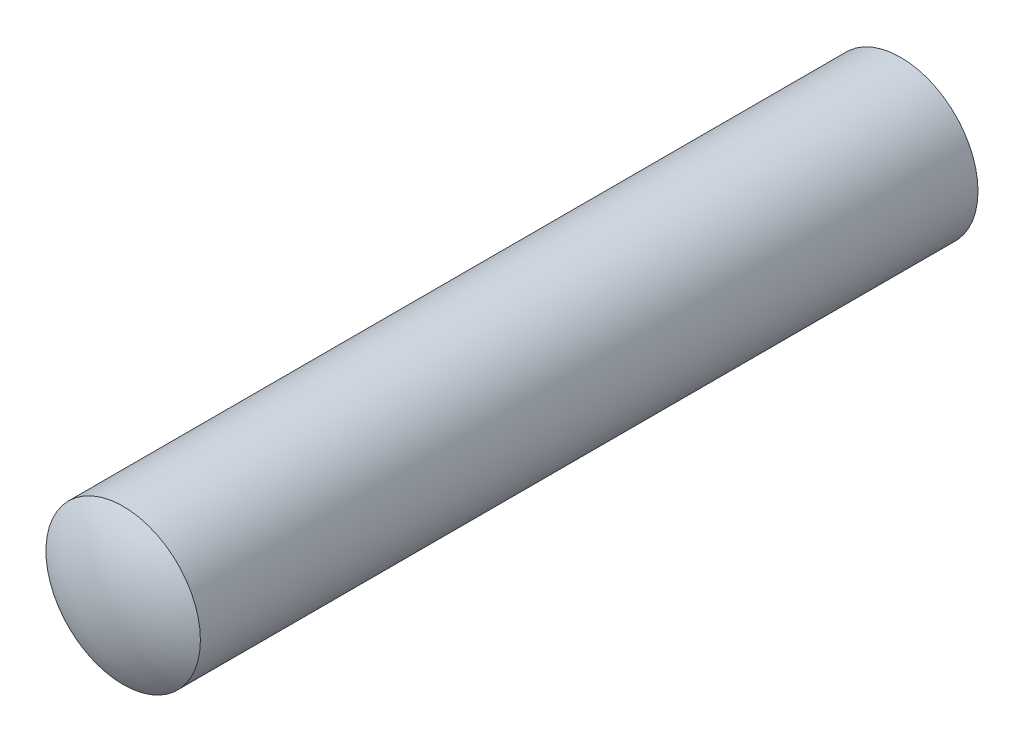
ISO-10303-21;
HEADER;
FILE_DESCRIPTION(('STEP AP214'),'2;1');
FILE_NAME('part.step','',(''),(''),'','','');
FILE_SCHEMA(('AUTOMOTIVE_DESIGN { 1 0 10303 214 1 1 1 1 }'));
ENDSEC;
DATA;
#1=APPLICATION_CONTEXT('core data for automotive mechanical design processes');
#2=APPLICATION_PROTOCOL_DEFINITION('international standard','automotive_design',2000,#1);
#3=PRODUCT_CONTEXT('',#1,'mechanical');
#4=PRODUCT('Part','Part','',(#3));
#5=PRODUCT_RELATED_PRODUCT_CATEGORY('part','',(#4));
#6=PRODUCT_DEFINITION_FORMATION('','',#4);
#7=PRODUCT_DEFINITION_CONTEXT('part definition',#1,'design');
#8=PRODUCT_DEFINITION('design','',#6,#7);
#9=PRODUCT_DEFINITION_SHAPE('','',#8);
#10=(LENGTH_UNIT() NAMED_UNIT(*) SI_UNIT(.MILLI.,.METRE.));
#11=(NAMED_UNIT(*) PLANE_ANGLE_UNIT() SI_UNIT($,.RADIAN.));
#12=(NAMED_UNIT(*) SI_UNIT($,.STERADIAN.) SOLID_ANGLE_UNIT());
#13=UNCERTAINTY_MEASURE_WITH_UNIT(LENGTH_MEASURE(1.E-05),#10,'distance_accuracy_value','');
#14=(GEOMETRIC_REPRESENTATION_CONTEXT(3) GLOBAL_UNCERTAINTY_ASSIGNED_CONTEXT((#13)) GLOBAL_UNIT_ASSIGNED_CONTEXT((#10,
#11,#12)) REPRESENTATION_CONTEXT('',''));
#15=CARTESIAN_POINT('',(0.,0.,0.));
#16=DIRECTION('',(0.,0.,1.));
#17=DIRECTION('',(1.,0.,0.));
#18=AXIS2_PLACEMENT_3D('',#15,#16,#17);
#19=CARTESIAN_POINT('',(0.,-1.52655665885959E-13,-2.72500000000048));
#20=DIRECTION('',(0.,0.,0.999999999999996));
#21=DIRECTION('',(0.,-1.00000000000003,0.));
#22=AXIS2_PLACEMENT_3D('',#19,#20,#21);
#23=SPHERICAL_SURFACE('',#22,2.72500000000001);
#24=CARTESIAN_POINT('',(0.,0.,-0.450000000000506));
#25=DIRECTION('',(0.,0.,0.999999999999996));
#26=DIRECTION('',(1.00000000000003,0.,0.));
#27=AXIS2_PLACEMENT_3D('',#24,#25,#26);
#28=CIRCLE('',#27,1.5);
#29=CARTESIAN_POINT('',(1.50000000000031,1.66575087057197E-13,-0.450000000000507));
#30=VERTEX_POINT('',#29);
#31=EDGE_CURVE('E10',#30,#30,#28,.T.);
#32=ORIENTED_EDGE('',*,*,#31,.T.);
#33=EDGE_LOOP('',(#32));
#34=FACE_BOUND('',#33,.T.);
#35=ADVANCED_FACE('F36',(#34),#23,.T.);
#36=CARTESIAN_POINT('',(2.63677968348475E-13,1.66533453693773E-13,10.7228972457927));
#37=DIRECTION('',(0.,0.,0.999999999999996));
#38=DIRECTION('',(1.00000000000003,0.,0.));
#39=AXIS2_PLACEMENT_3D('',#36,#37,#38);
#40=CYLINDRICAL_SURFACE('',#39,1.5);
#41=CARTESIAN_POINT('',(2.08166817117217E-13,-3.05311331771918E-13,-15.5500000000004));
#42=DIRECTION('',(0.,0.,0.999999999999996));
#43=DIRECTION('',(1.00000000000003,0.,0.));
#44=AXIS2_PLACEMENT_3D('',#41,#42,#43);
#45=CIRCLE('',#44,1.5);
#46=CARTESIAN_POINT('',(1.50000000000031,1.66575087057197E-13,-15.5500000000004));
#47=VERTEX_POINT('',#46);
#48=EDGE_CURVE('E42',#47,#47,#45,.T.);
#49=CARTESIAN_POINT('',(1.50000000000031,1.66575087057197E-13,-0.450000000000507));
#50=CARTESIAN_POINT('',(1.50000000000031,1.66575087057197E-13,-0.607291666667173));
#51=CARTESIAN_POINT('',(1.50000000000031,1.66575087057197E-13,-0.764583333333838));
#52=CARTESIAN_POINT('',(1.50000000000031,1.66575087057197E-13,-1.07916666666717));
#53=CARTESIAN_POINT('',(1.50000000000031,1.66575087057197E-13,-1.23645833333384));
#54=CARTESIAN_POINT('',(1.50000000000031,1.66575087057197E-13,-1.55104166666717));
#55=CARTESIAN_POINT('',(1.50000000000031,1.66575087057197E-13,-1.70833333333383));
#56=CARTESIAN_POINT('',(1.50000000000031,1.66575087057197E-13,-2.02291666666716));
#57=CARTESIAN_POINT('',(1.50000000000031,1.66575087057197E-13,-2.18020833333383));
#58=CARTESIAN_POINT('',(1.50000000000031,1.66575087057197E-13,-2.49479166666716));
#59=CARTESIAN_POINT('',(1.50000000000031,1.66575087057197E-13,-2.65208333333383));
#60=CARTESIAN_POINT('',(1.50000000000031,1.66575087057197E-13,-2.96666666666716));
#61=CARTESIAN_POINT('',(1.50000000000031,1.66575087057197E-13,-3.12395833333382));
#62=CARTESIAN_POINT('',(1.50000000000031,1.66575087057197E-13,-3.43854166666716));
#63=CARTESIAN_POINT('',(1.50000000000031,1.66575087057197E-13,-3.59583333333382));
#64=CARTESIAN_POINT('',(1.50000000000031,1.66575087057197E-13,-3.91041666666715));
#65=CARTESIAN_POINT('',(1.50000000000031,1.66575087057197E-13,-4.06770833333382));
#66=CARTESIAN_POINT('',(1.50000000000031,1.66575087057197E-13,-4.38229166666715));
#67=CARTESIAN_POINT('',(1.50000000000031,1.66575087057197E-13,-4.53958333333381));
#68=CARTESIAN_POINT('',(1.50000000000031,1.66575087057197E-13,-4.85416666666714));
#69=CARTESIAN_POINT('',(1.50000000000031,1.66575087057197E-13,-5.01145833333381));
#70=CARTESIAN_POINT('',(1.50000000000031,1.66575087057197E-13,-5.32604166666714));
#71=CARTESIAN_POINT('',(1.50000000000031,1.66575087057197E-13,-5.48333333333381));
#72=CARTESIAN_POINT('',(1.50000000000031,1.66575087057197E-13,-5.79791666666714));
#73=CARTESIAN_POINT('',(1.50000000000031,1.66575087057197E-13,-5.95520833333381));
#74=CARTESIAN_POINT('',(1.50000000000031,1.66575087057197E-13,-6.26979166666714));
#75=CARTESIAN_POINT('',(1.50000000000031,1.66575087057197E-13,-6.4270833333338));
#76=CARTESIAN_POINT('',(1.50000000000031,1.66575087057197E-13,-6.74166666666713));
#77=CARTESIAN_POINT('',(1.50000000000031,1.66575087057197E-13,-6.8989583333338));
#78=CARTESIAN_POINT('',(1.50000000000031,1.66575087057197E-13,-7.21354166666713));
#79=CARTESIAN_POINT('',(1.50000000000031,1.66575087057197E-13,-7.3708333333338));
#80=CARTESIAN_POINT('',(1.50000000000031,1.66575087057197E-13,-7.68541666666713));
#81=CARTESIAN_POINT('',(1.50000000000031,1.66575087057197E-13,-7.84270833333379));
#82=CARTESIAN_POINT('',(1.50000000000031,1.66575087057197E-13,-8.15729166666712));
#83=CARTESIAN_POINT('',(1.50000000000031,1.66575087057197E-13,-8.31458333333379));
#84=CARTESIAN_POINT('',(1.50000000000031,1.66575087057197E-13,-8.62916666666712));
#85=CARTESIAN_POINT('',(1.50000000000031,1.66575087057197E-13,-8.78645833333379));
#86=CARTESIAN_POINT('',(1.50000000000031,1.66575087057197E-13,-9.10104166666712));
#87=CARTESIAN_POINT('',(1.50000000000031,1.66575087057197E-13,-9.25833333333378));
#88=CARTESIAN_POINT('',(1.50000000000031,1.66575087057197E-13,-9.57291666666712));
#89=CARTESIAN_POINT('',(1.50000000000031,1.66575087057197E-13,-9.73020833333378));
#90=CARTESIAN_POINT('',(1.50000000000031,1.66575087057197E-13,-10.0447916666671));
#91=CARTESIAN_POINT('',(1.50000000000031,1.66575087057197E-13,-10.2020833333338));
#92=CARTESIAN_POINT('',(1.50000000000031,1.66575087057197E-13,-10.5166666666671));
#93=CARTESIAN_POINT('',(1.50000000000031,1.66575087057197E-13,-10.6739583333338));
#94=CARTESIAN_POINT('',(1.50000000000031,1.66575087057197E-13,-10.9885416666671));
#95=CARTESIAN_POINT('',(1.50000000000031,1.66575087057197E-13,-11.1458333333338));
#96=CARTESIAN_POINT('',(1.50000000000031,1.66575087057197E-13,-11.4604166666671));
#97=CARTESIAN_POINT('',(1.50000000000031,1.66575087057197E-13,-11.6177083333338));
#98=CARTESIAN_POINT('',(1.50000000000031,1.66575087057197E-13,-11.9322916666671));
#99=CARTESIAN_POINT('',(1.50000000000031,1.66575087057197E-13,-12.0895833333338));
#100=CARTESIAN_POINT('',(1.50000000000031,1.66575087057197E-13,-12.4041666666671));
#101=CARTESIAN_POINT('',(1.50000000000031,1.66575087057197E-13,-12.5614583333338));
#102=CARTESIAN_POINT('',(1.50000000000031,1.66575087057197E-13,-12.8760416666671));
#103=CARTESIAN_POINT('',(1.50000000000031,1.66575087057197E-13,-13.0333333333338));
#104=CARTESIAN_POINT('',(1.50000000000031,1.66575087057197E-13,-13.3479166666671));
#105=CARTESIAN_POINT('',(1.50000000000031,1.66575087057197E-13,-13.5052083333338));
#106=CARTESIAN_POINT('',(1.50000000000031,1.66575087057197E-13,-13.8197916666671));
#107=CARTESIAN_POINT('',(1.50000000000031,1.66575087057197E-13,-13.9770833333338));
#108=CARTESIAN_POINT('',(1.50000000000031,1.66575087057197E-13,-14.2916666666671));
#109=CARTESIAN_POINT('',(1.50000000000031,1.66575087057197E-13,-14.4489583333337));
#110=CARTESIAN_POINT('',(1.50000000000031,1.66575087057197E-13,-14.7635416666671));
#111=CARTESIAN_POINT('',(1.50000000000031,1.66575087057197E-13,-14.9208333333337));
#112=CARTESIAN_POINT('',(1.50000000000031,1.66575087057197E-13,-15.2354166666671));
#113=CARTESIAN_POINT('',(1.50000000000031,1.66575087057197E-13,-15.3927083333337));
#114=CARTESIAN_POINT('',(1.50000000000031,1.66575087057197E-13,-15.5500000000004));
#115=B_SPLINE_CURVE_WITH_KNOTS('',3,(#49,#50,#51,#52,#53,#54,#55,#56,#57,#58,#59,#60,#61,#62,
#63,#64,#65,#66,#67,#68,#69,#70,#71,#72,#73,#74,#75,#76,#77,#78,#79,#80,#81,#82,#83,#84,#85,#86,
#87,#88,#89,#90,#91,#92,#93,#94,#95,#96,#97,#98,#99,#100,#101,#102,#103,#104,#105,#106,#107,
#108,#109,#110,#111,#112,#113,#114),.UNSPECIFIED.,.F.,.F.,(4,2,2,2,2,2,2,2,2,2,2,2,2,2,2,2,2,2,
2,2,2,2,2,2,2,2,2,2,2,2,2,2,4),(0.,0.471874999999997,0.943749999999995,1.41562499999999,
1.88749999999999,2.35937499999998,2.83124999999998,3.30312499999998,3.77499999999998,
4.24687499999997,4.71874999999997,5.19062499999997,5.66249999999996,6.13437499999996,
6.60624999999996,7.07812499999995,7.54999999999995,8.02187499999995,8.49374999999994,
8.96562499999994,9.43749999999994,9.90937499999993,10.3812499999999,10.8531249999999,
11.3249999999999,11.7968749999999,12.2687499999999,12.7406249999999,13.2124999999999,
13.6843749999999,14.1562499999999,14.6281249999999,15.0999999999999),.UNSPECIFIED.);
#116=EDGE_CURVE('BSEAM51',#30,#47,#115,.T.);
#117=ORIENTED_EDGE('',*,*,#31,.F.);
#118=ORIENTED_EDGE('',*,*,#48,.T.);
#119=ORIENTED_EDGE('',*,*,#116,.T.);
#120=ORIENTED_EDGE('',*,*,#116,.F.);
#121=EDGE_LOOP('',(#117,#119,#118,#120));
#122=FACE_BOUND('',#121,.T.);
#123=ADVANCED_FACE('F51',(#122),#40,.T.);
#124=CARTESIAN_POINT('',(3.32199545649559E-13,2.91433543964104E-13,-13.2750000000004));
#125=DIRECTION('',(0.,0.,0.999999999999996));
#126=DIRECTION('',(0.,1.00000000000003,0.));
#127=AXIS2_PLACEMENT_3D('',#124,#125,#126);
#128=SPHERICAL_SURFACE('',#127,2.725);
#129=ORIENTED_EDGE('',*,*,#48,.F.);
#130=EDGE_LOOP('',(#129));
#131=FACE_BOUND('',#130,.T.);
#132=ADVANCED_FACE('F53',(#131),#128,.T.);
#133=CLOSED_SHELL('',(#35,#123,#132));
#134=MANIFOLD_SOLID_BREP('B2',#133);
#135=ADVANCED_BREP_SHAPE_REPRESENTATION('',(#18,#134),#14);
#136=SHAPE_DEFINITION_REPRESENTATION(#9,#135);
ENDSEC;
END-ISO-10303-21;
